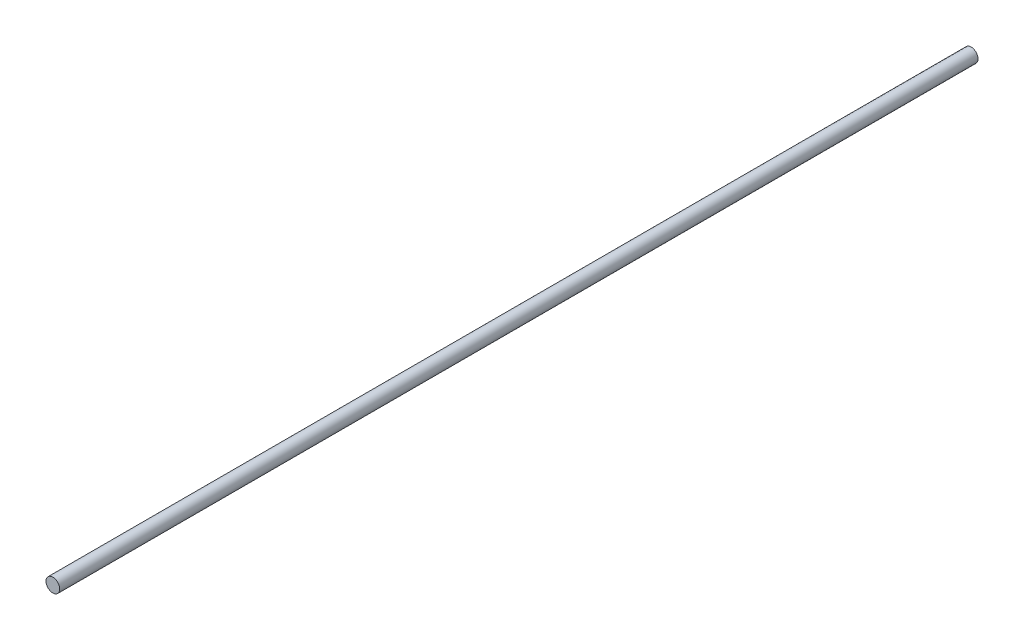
ISO-10303-21;
HEADER;
FILE_DESCRIPTION(('STEP AP214'),'2;1');
FILE_NAME('part.step','',(''),(''),'','','');
FILE_SCHEMA(('AUTOMOTIVE_DESIGN { 1 0 10303 214 1 1 1 1 }'));
ENDSEC;
DATA;
#1=APPLICATION_CONTEXT('core data for automotive mechanical design processes');
#2=APPLICATION_PROTOCOL_DEFINITION('international standard','automotive_design',2000,#1);
#3=PRODUCT_CONTEXT('',#1,'mechanical');
#4=PRODUCT('Part','Part','',(#3));
#5=PRODUCT_RELATED_PRODUCT_CATEGORY('part','',(#4));
#6=PRODUCT_DEFINITION_FORMATION('','',#4);
#7=PRODUCT_DEFINITION_CONTEXT('part definition',#1,'design');
#8=PRODUCT_DEFINITION('design','',#6,#7);
#9=PRODUCT_DEFINITION_SHAPE('','',#8);
#10=(LENGTH_UNIT() NAMED_UNIT(*) SI_UNIT(.MILLI.,.METRE.));
#11=(NAMED_UNIT(*) PLANE_ANGLE_UNIT() SI_UNIT($,.RADIAN.));
#12=(NAMED_UNIT(*) SI_UNIT($,.STERADIAN.) SOLID_ANGLE_UNIT());
#13=UNCERTAINTY_MEASURE_WITH_UNIT(LENGTH_MEASURE(1.E-05),#10,'distance_accuracy_value','');
#14=(GEOMETRIC_REPRESENTATION_CONTEXT(3) GLOBAL_UNCERTAINTY_ASSIGNED_CONTEXT((#13)) GLOBAL_UNIT_ASSIGNED_CONTEXT((#10,
#11,#12)) REPRESENTATION_CONTEXT('',''));
#15=CARTESIAN_POINT('',(0.,0.,0.));
#16=DIRECTION('',(0.,0.,1.));
#17=DIRECTION('',(1.,0.,0.));
#18=AXIS2_PLACEMENT_3D('',#15,#16,#17);
#19=CARTESIAN_POINT('',(0.,0.,167.));
#20=DIRECTION('',(0.,0.,-1.));
#21=DIRECTION('',(-1.,0.,0.));
#22=AXIS2_PLACEMENT_3D('',#19,#20,#21);
#23=CYLINDRICAL_SURFACE('',#22,1.25);
#24=CARTESIAN_POINT('',(0.,0.,167.));
#25=DIRECTION('',(0.,0.,1.));
#26=DIRECTION('',(1.,0.,0.));
#27=AXIS2_PLACEMENT_3D('',#24,#25,#26);
#28=CIRCLE('',#27,1.25);
#29=CARTESIAN_POINT('',(-1.25,0.,167.));
#30=VERTEX_POINT('',#29);
#31=EDGE_CURVE('E10',#30,#30,#28,.T.);
#32=CARTESIAN_POINT('',(0.,0.,0.));
#33=DIRECTION('',(0.,0.,1.));
#34=DIRECTION('',(1.,0.,0.));
#35=AXIS2_PLACEMENT_3D('',#32,#33,#34);
#36=CIRCLE('',#35,1.25);
#37=CARTESIAN_POINT('',(-1.25,0.,0.));
#38=VERTEX_POINT('',#37);
#39=EDGE_CURVE('E34',#38,#38,#36,.T.);
#40=CARTESIAN_POINT('',(-1.25,0.,167.));
#41=CARTESIAN_POINT('',(-1.25,0.,165.260416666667));
#42=CARTESIAN_POINT('',(-1.25,0.,163.520833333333));
#43=CARTESIAN_POINT('',(-1.25,0.,160.041666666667));
#44=CARTESIAN_POINT('',(-1.25,0.,158.302083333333));
#45=CARTESIAN_POINT('',(-1.25,0.,154.822916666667));
#46=CARTESIAN_POINT('',(-1.25,0.,153.083333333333));
#47=CARTESIAN_POINT('',(-1.25,0.,149.604166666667));
#48=CARTESIAN_POINT('',(-1.25,0.,147.864583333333));
#49=CARTESIAN_POINT('',(-1.25,0.,144.385416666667));
#50=CARTESIAN_POINT('',(-1.25,0.,142.645833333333));
#51=CARTESIAN_POINT('',(-1.25,0.,139.166666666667));
#52=CARTESIAN_POINT('',(-1.25,0.,137.427083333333));
#53=CARTESIAN_POINT('',(-1.25,0.,133.947916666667));
#54=CARTESIAN_POINT('',(-1.25,0.,132.208333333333));
#55=CARTESIAN_POINT('',(-1.25,0.,128.729166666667));
#56=CARTESIAN_POINT('',(-1.25,0.,126.989583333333));
#57=CARTESIAN_POINT('',(-1.25,0.,123.510416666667));
#58=CARTESIAN_POINT('',(-1.25,0.,121.770833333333));
#59=CARTESIAN_POINT('',(-1.25,0.,118.291666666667));
#60=CARTESIAN_POINT('',(-1.25,0.,116.552083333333));
#61=CARTESIAN_POINT('',(-1.25,0.,113.072916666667));
#62=CARTESIAN_POINT('',(-1.25,0.,111.333333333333));
#63=CARTESIAN_POINT('',(-1.25,0.,107.854166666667));
#64=CARTESIAN_POINT('',(-1.25,0.,106.114583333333));
#65=CARTESIAN_POINT('',(-1.25,0.,102.635416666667));
#66=CARTESIAN_POINT('',(-1.25,0.,100.895833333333));
#67=CARTESIAN_POINT('',(-1.25,0.,97.4166666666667));
#68=CARTESIAN_POINT('',(-1.25,0.,95.6770833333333));
#69=CARTESIAN_POINT('',(-1.25,0.,92.1979166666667));
#70=CARTESIAN_POINT('',(-1.25,0.,90.4583333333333));
#71=CARTESIAN_POINT('',(-1.25,0.,86.9791666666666));
#72=CARTESIAN_POINT('',(-1.25,0.,85.2395833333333));
#73=CARTESIAN_POINT('',(-1.25,0.,81.7604166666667));
#74=CARTESIAN_POINT('',(-1.25,0.,80.0208333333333));
#75=CARTESIAN_POINT('',(-1.25,0.,76.5416666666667));
#76=CARTESIAN_POINT('',(-1.25,0.,74.8020833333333));
#77=CARTESIAN_POINT('',(-1.25,0.,71.3229166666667));
#78=CARTESIAN_POINT('',(-1.25,0.,69.5833333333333));
#79=CARTESIAN_POINT('',(-1.25,0.,66.1041666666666));
#80=CARTESIAN_POINT('',(-1.25,0.,64.3645833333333));
#81=CARTESIAN_POINT('',(-1.25,0.,60.8854166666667));
#82=CARTESIAN_POINT('',(-1.25,0.,59.1458333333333));
#83=CARTESIAN_POINT('',(-1.25,0.,55.6666666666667));
#84=CARTESIAN_POINT('',(-1.25,0.,53.9270833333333));
#85=CARTESIAN_POINT('',(-1.25,0.,50.4479166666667));
#86=CARTESIAN_POINT('',(-1.25,0.,48.7083333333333));
#87=CARTESIAN_POINT('',(-1.25,0.,45.2291666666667));
#88=CARTESIAN_POINT('',(-1.25,0.,43.4895833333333));
#89=CARTESIAN_POINT('',(-1.25,0.,40.0104166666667));
#90=CARTESIAN_POINT('',(-1.25,0.,38.2708333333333));
#91=CARTESIAN_POINT('',(-1.25,0.,34.7916666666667));
#92=CARTESIAN_POINT('',(-1.25,0.,33.0520833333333));
#93=CARTESIAN_POINT('',(-1.25,0.,29.5729166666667));
#94=CARTESIAN_POINT('',(-1.25,0.,27.8333333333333));
#95=CARTESIAN_POINT('',(-1.25,0.,24.3541666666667));
#96=CARTESIAN_POINT('',(-1.25,0.,22.6145833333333));
#97=CARTESIAN_POINT('',(-1.25,0.,19.1354166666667));
#98=CARTESIAN_POINT('',(-1.25,0.,17.3958333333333));
#99=CARTESIAN_POINT('',(-1.25,0.,13.9166666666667));
#100=CARTESIAN_POINT('',(-1.25,0.,12.1770833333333));
#101=CARTESIAN_POINT('',(-1.25,0.,8.69791666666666));
#102=CARTESIAN_POINT('',(-1.25,0.,6.95833333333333));
#103=CARTESIAN_POINT('',(-1.25,0.,3.47916666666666));
#104=CARTESIAN_POINT('',(-1.25,0.,1.73958333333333));
#105=CARTESIAN_POINT('',(-1.25,0.,0.));
#106=B_SPLINE_CURVE_WITH_KNOTS('',3,(#40,#41,#42,#43,#44,#45,#46,#47,#48,#49,#50,#51,#52,#53,
#54,#55,#56,#57,#58,#59,#60,#61,#62,#63,#64,#65,#66,#67,#68,#69,#70,#71,#72,#73,#74,#75,#76,#77,
#78,#79,#80,#81,#82,#83,#84,#85,#86,#87,#88,#89,#90,#91,#92,#93,#94,#95,#96,#97,#98,#99,#100,
#101,#102,#103,#104,#105),.UNSPECIFIED.,.F.,.F.,(4,2,2,2,2,2,2,2,2,2,2,2,2,2,2,2,2,2,2,2,2,2,2,
2,2,2,2,2,2,2,2,2,4),(0.,5.21875000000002,10.4375,15.65625,20.875,26.09375,31.3125,36.53125,
41.75,46.96875,52.1875,57.40625,62.625,67.84375,73.0625,78.28125,83.5,88.71875,93.9375,99.15625,
104.375,109.59375,114.8125,120.03125,125.25,130.46875,135.6875,140.90625,146.125,151.34375,
156.5625,161.78125,167.),.UNSPECIFIED.);
#107=EDGE_CURVE('BSEAM31',#30,#38,#106,.T.);
#108=ORIENTED_EDGE('',*,*,#31,.F.);
#109=ORIENTED_EDGE('',*,*,#39,.T.);
#110=ORIENTED_EDGE('',*,*,#107,.T.);
#111=ORIENTED_EDGE('',*,*,#107,.F.);
#112=EDGE_LOOP('',(#108,#110,#109,#111));
#113=FACE_BOUND('',#112,.T.);
#114=ADVANCED_FACE('F31',(#113),#23,.T.);
#115=CARTESIAN_POINT('',(0.,0.,167.));
#116=DIRECTION('',(0.,0.,1.));
#117=DIRECTION('',(1.,0.,0.));
#118=AXIS2_PLACEMENT_3D('',#115,#116,#117);
#119=PLANE('',#118);
#120=ORIENTED_EDGE('',*,*,#31,.T.);
#121=EDGE_LOOP('',(#120));
#122=FACE_BOUND('',#121,.T.);
#123=ADVANCED_FACE('F46',(#122),#119,.T.);
#124=CARTESIAN_POINT('',(0.,0.,0.));
#125=DIRECTION('',(0.,0.,1.));
#126=DIRECTION('',(1.,0.,0.));
#127=AXIS2_PLACEMENT_3D('',#124,#125,#126);
#128=PLANE('',#127);
#129=ORIENTED_EDGE('',*,*,#39,.F.);
#130=EDGE_LOOP('',(#129));
#131=FACE_BOUND('',#130,.T.);
#132=ADVANCED_FACE('F44',(#131),#128,.F.);
#133=CLOSED_SHELL('',(#114,#123,#132));
#134=MANIFOLD_SOLID_BREP('B2',#133);
#135=ADVANCED_BREP_SHAPE_REPRESENTATION('',(#18,#134),#14);
#136=SHAPE_DEFINITION_REPRESENTATION(#9,#135);
ENDSEC;
END-ISO-10303-21;
